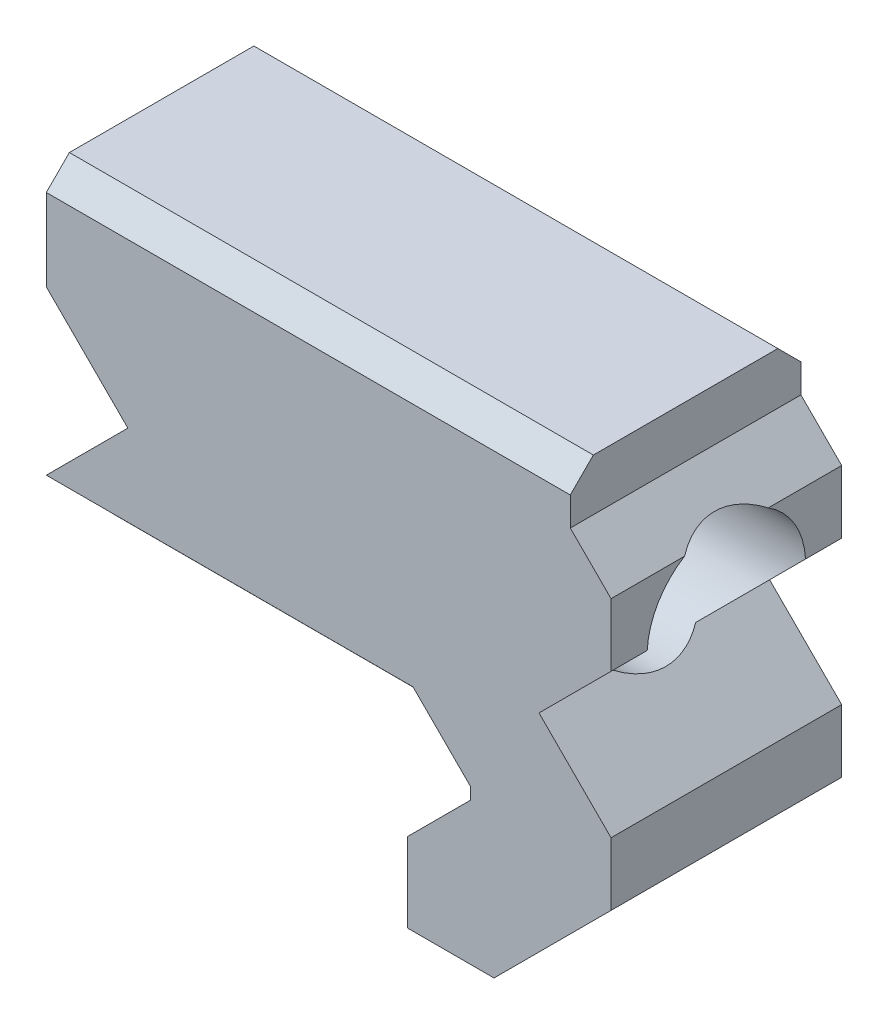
ISO-10303-21;
HEADER;
FILE_DESCRIPTION(('STEP AP214'),'2;1');
FILE_NAME('part.step','',(''),(''),'','','');
FILE_SCHEMA(('AUTOMOTIVE_DESIGN { 1 0 10303 214 1 1 1 1 }'));
ENDSEC;
DATA;
#1=APPLICATION_CONTEXT('core data for automotive mechanical design processes');
#2=APPLICATION_PROTOCOL_DEFINITION('international standard','automotive_design',2000,#1);
#3=PRODUCT_CONTEXT('',#1,'mechanical');
#4=PRODUCT('Part','Part','',(#3));
#5=PRODUCT_RELATED_PRODUCT_CATEGORY('part','',(#4));
#6=PRODUCT_DEFINITION_FORMATION('','',#4);
#7=PRODUCT_DEFINITION_CONTEXT('part definition',#1,'design');
#8=PRODUCT_DEFINITION('design','',#6,#7);
#9=PRODUCT_DEFINITION_SHAPE('','',#8);
#10=(LENGTH_UNIT() NAMED_UNIT(*) SI_UNIT(.MILLI.,.METRE.));
#11=(NAMED_UNIT(*) PLANE_ANGLE_UNIT() SI_UNIT($,.RADIAN.));
#12=(NAMED_UNIT(*) SI_UNIT($,.STERADIAN.) SOLID_ANGLE_UNIT());
#13=UNCERTAINTY_MEASURE_WITH_UNIT(LENGTH_MEASURE(1.E-05),#10,'distance_accuracy_value','');
#14=(GEOMETRIC_REPRESENTATION_CONTEXT(3) GLOBAL_UNCERTAINTY_ASSIGNED_CONTEXT((#13)) GLOBAL_UNIT_ASSIGNED_CONTEXT((#10,
#11,#12)) REPRESENTATION_CONTEXT('',''));
#15=CARTESIAN_POINT('',(0.,0.,0.));
#16=DIRECTION('',(0.,0.,1.));
#17=DIRECTION('',(1.,0.,0.));
#18=AXIS2_PLACEMENT_3D('',#15,#16,#17);
#19=CARTESIAN_POINT('',(-4.81965000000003,2.794,3.25754999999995));
#20=DIRECTION('',(0.,1.,0.));
#21=DIRECTION('',(-1.,0.,0.));
#22=AXIS2_PLACEMENT_3D('',#19,#20,#21);
#23=PLANE('',#22);
#24=DIRECTION('',(0.,0.,-1.));
#25=VECTOR('',#24,1.);
#26=CARTESIAN_POINT('',(11.33475,2.794,3.25755000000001));
#27=LINE('',#26,#25);
#28=CARTESIAN_POINT('',(11.33475,2.794,0.717550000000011));
#29=VERTEX_POINT('',#28);
#30=CARTESIAN_POINT('',(11.33475,2.794,-1.74624999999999));
#31=VERTEX_POINT('',#30);
#32=EDGE_CURVE('E392',#29,#31,#27,.T.);
#33=ORIENTED_EDGE('',*,*,#32,.F.);
#34=DIRECTION('',(-1.,0.,0.));
#35=VECTOR('',#34,1.);
#36=CARTESIAN_POINT('',(-4.81965000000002,2.794,0.717549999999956));
#37=LINE('',#36,#35);
#38=CARTESIAN_POINT('',(-4.81965000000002,2.794,0.717549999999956));
#39=VERTEX_POINT('',#38);
#40=EDGE_CURVE('E261',#29,#39,#37,.T.);
#41=ORIENTED_EDGE('',*,*,#40,.T.);
#42=DIRECTION('',(0.,0.,-1.));
#43=VECTOR('',#42,1.);
#44=CARTESIAN_POINT('',(-4.81965000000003,2.794,3.25754999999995));
#45=LINE('',#44,#43);
#46=CARTESIAN_POINT('',(-4.81965000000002,2.794,-1.74625000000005));
#47=VERTEX_POINT('',#46);
#48=EDGE_CURVE('E396',#39,#47,#45,.T.);
#49=ORIENTED_EDGE('',*,*,#48,.T.);
#50=DIRECTION('',(-1.,0.,0.));
#51=VECTOR('',#50,1.);
#52=CARTESIAN_POINT('',(-4.81965000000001,2.794,-1.74625000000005));
#53=LINE('',#52,#51);
#54=EDGE_CURVE('E277',#31,#47,#53,.T.);
#55=ORIENTED_EDGE('',*,*,#54,.F.);
#56=EDGE_LOOP('',(#33,#41,#49,#55));
#57=FACE_BOUND('',#56,.T.);
#58=ADVANCED_FACE('F53',(#57),#23,.F.);
#59=CARTESIAN_POINT('',(-4.81964999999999,2.794,-6.97865000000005));
#60=VERTEX_POINT('',#59);
#61=CARTESIAN_POINT('',(-4.81964999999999,2.794,-9.44245000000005));
#62=VERTEX_POINT('',#61);
#63=EDGE_CURVE('E395',#60,#62,#45,.T.);
#64=ORIENTED_EDGE('',*,*,#63,.T.);
#65=DIRECTION('',(1.,0.,0.));
#66=VECTOR('',#65,1.);
#67=CARTESIAN_POINT('',(-4.81964999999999,2.794,-9.44245000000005));
#68=LINE('',#67,#66);
#69=CARTESIAN_POINT('',(11.33475,2.794,-9.44244999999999));
#70=VERTEX_POINT('',#69);
#71=EDGE_CURVE('E444',#62,#70,#68,.T.);
#72=ORIENTED_EDGE('',*,*,#71,.T.);
#73=CARTESIAN_POINT('',(11.33475,2.794,-6.97864999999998));
#74=VERTEX_POINT('',#73);
#75=EDGE_CURVE('E391',#74,#70,#27,.T.);
#76=ORIENTED_EDGE('',*,*,#75,.F.);
#77=DIRECTION('',(1.,0.,0.));
#78=VECTOR('',#77,1.);
#79=CARTESIAN_POINT('',(-4.81964999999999,2.794,-6.97865000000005));
#80=LINE('',#79,#78);
#81=EDGE_CURVE('E294',#60,#74,#80,.T.);
#82=ORIENTED_EDGE('',*,*,#81,.F.);
#83=EDGE_LOOP('',(#64,#72,#76,#82));
#84=FACE_BOUND('',#83,.T.);
#85=ADVANCED_FACE('F443',(#84),#23,.F.);
#86=CARTESIAN_POINT('',(20.05965,-1.3716,3.25755000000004));
#87=DIRECTION('',(-1.,0.,0.));
#88=DIRECTION('',(0.,-1.,0.));
#89=AXIS2_PLACEMENT_3D('',#86,#87,#88);
#90=PLANE('',#89);
#91=DIRECTION('',(0.,0.,-1.));
#92=VECTOR('',#91,1.);
#93=CARTESIAN_POINT('',(20.0596499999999,7.75067438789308,10.3570658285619));
#94=LINE('',#93,#92);
#95=CARTESIAN_POINT('',(20.05965,7.75067438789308,-7.84954801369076));
#96=VERTEX_POINT('',#95);
#97=CARTESIAN_POINT('',(20.05965,7.75067438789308,-9.44244999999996));
#98=VERTEX_POINT('',#97);
#99=EDGE_CURVE('E344',#96,#98,#94,.T.);
#100=ORIENTED_EDGE('',*,*,#99,.T.);
#101=DIRECTION('',(0.,1.,0.));
#102=VECTOR('',#101,1.);
#103=CARTESIAN_POINT('',(20.05965,-1.3716,-9.44244999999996));
#104=LINE('',#103,#102);
#105=CARTESIAN_POINT('',(20.05965,10.5229487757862,-9.44244999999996));
#106=VERTEX_POINT('',#105);
#107=EDGE_CURVE('E501',#98,#106,#104,.T.);
#108=ORIENTED_EDGE('',*,*,#107,.T.);
#109=DIRECTION('',(0.,0.,-1.));
#110=VECTOR('',#109,1.);
#111=CARTESIAN_POINT('',(20.05965,10.5229487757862,3.25755000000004));
#112=LINE('',#111,#110);
#113=CARTESIAN_POINT('',(20.05965,10.5229487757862,-6.20574539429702));
#114=VERTEX_POINT('',#113);
#115=EDGE_CURVE('E363',#114,#106,#112,.T.);
#116=ORIENTED_EDGE('',*,*,#115,.F.);
#117=CARTESIAN_POINT('',(20.05965,7.5565,-4.36244999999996));
#118=DIRECTION('',(-1.,0.,0.));
#119=DIRECTION('',(0.,-1.,0.));
#120=AXIS2_PLACEMENT_3D('',#117,#118,#119);
#121=CIRCLE('',#120,3.4925);
#122=EDGE_CURVE('E318',#114,#96,#121,.T.);
#123=ORIENTED_EDGE('',*,*,#122,.T.);
#124=EDGE_LOOP('',(#100,#108,#116,#123));
#125=FACE_BOUND('',#124,.T.);
#126=ADVANCED_FACE('F647',(#125),#90,.F.);
#127=CARTESIAN_POINT('',(20.05965,10.5229487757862,0.717550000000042));
#128=VERTEX_POINT('',#127);
#129=CARTESIAN_POINT('',(20.05965,10.5229487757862,-2.51915460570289));
#130=VERTEX_POINT('',#129);
#131=EDGE_CURVE('E364',#128,#130,#112,.T.);
#132=ORIENTED_EDGE('',*,*,#131,.F.);
#133=DIRECTION('',(0.,-1.,0.));
#134=VECTOR('',#133,1.);
#135=CARTESIAN_POINT('',(20.05965,-1.3716,0.717550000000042));
#136=LINE('',#135,#134);
#137=CARTESIAN_POINT('',(20.05965,7.75067438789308,0.717550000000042));
#138=VERTEX_POINT('',#137);
#139=EDGE_CURVE('E557',#128,#138,#136,.T.);
#140=ORIENTED_EDGE('',*,*,#139,.T.);
#141=CARTESIAN_POINT('',(20.05965,7.75067438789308,-0.875351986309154));
#142=VERTEX_POINT('',#141);
#143=EDGE_CURVE('E345',#138,#142,#94,.T.);
#144=ORIENTED_EDGE('',*,*,#143,.T.);
#145=CARTESIAN_POINT('',(20.05965,7.5565,-4.36244999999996));
#146=DIRECTION('',(-1.,0.,0.));
#147=DIRECTION('',(0.,-1.,0.));
#148=AXIS2_PLACEMENT_3D('',#145,#146,#147);
#149=CIRCLE('',#148,3.4925);
#150=EDGE_CURVE('E314',#142,#130,#149,.T.);
#151=ORIENTED_EDGE('',*,*,#150,.T.);
#152=EDGE_LOOP('',(#132,#140,#144,#151));
#153=FACE_BOUND('',#152,.T.);
#154=ADVANCED_FACE('F612',(#153),#90,.F.);
#155=DIRECTION('',(0.,0.,-1.));
#156=VECTOR('',#155,1.);
#157=CARTESIAN_POINT('',(20.0596499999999,1.40067438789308,10.3570658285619));
#158=LINE('',#157,#156);
#159=CARTESIAN_POINT('',(20.05965,1.40067438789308,0.717550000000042));
#160=VERTEX_POINT('',#159);
#161=CARTESIAN_POINT('',(20.05965,1.40067438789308,-9.44244999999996));
#162=VERTEX_POINT('',#161);
#163=EDGE_CURVE('E348',#160,#162,#158,.T.);
#164=ORIENTED_EDGE('',*,*,#163,.F.);
#165=DIRECTION('',(0.,-1.,0.));
#166=VECTOR('',#165,1.);
#167=CARTESIAN_POINT('',(20.05965,-1.3716,0.717550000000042));
#168=LINE('',#167,#166);
#169=CARTESIAN_POINT('',(20.05965,-1.3716,0.717550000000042));
#170=VERTEX_POINT('',#169);
#171=EDGE_CURVE('E553',#160,#170,#168,.T.);
#172=ORIENTED_EDGE('',*,*,#171,.T.);
#173=DIRECTION('',(0.,0.,-1.));
#174=VECTOR('',#173,1.);
#175=CARTESIAN_POINT('',(20.05965,-1.3716,3.25755000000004));
#176=LINE('',#175,#174);
#177=CARTESIAN_POINT('',(20.05965,-1.3716,-9.44244999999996));
#178=VERTEX_POINT('',#177);
#179=EDGE_CURVE('E367',#170,#178,#176,.T.);
#180=ORIENTED_EDGE('',*,*,#179,.T.);
#181=DIRECTION('',(0.,1.,0.));
#182=VECTOR('',#181,1.);
#183=CARTESIAN_POINT('',(20.05965,-1.3716,-9.44244999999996));
#184=LINE('',#183,#182);
#185=EDGE_CURVE('E494',#178,#162,#184,.T.);
#186=ORIENTED_EDGE('',*,*,#185,.T.);
#187=EDGE_LOOP('',(#164,#172,#180,#186));
#188=FACE_BOUND('',#187,.T.);
#189=ADVANCED_FACE('F600',(#188),#90,.F.);
#190=CARTESIAN_POINT('',(-1.22754755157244,6.38610244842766,25.7722212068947));
#191=DIRECTION('',(-0.707106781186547,-0.707106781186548,0.));
#192=DIRECTION('',(0.707106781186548,-0.707106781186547,0.));
#193=AXIS2_PLACEMENT_3D('',#190,#191,#192);
#194=PLANE('',#193);
#195=DIRECTION('',(-0.707106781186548,0.707106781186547,0.));
#196=VECTOR('',#195,1.);
#197=CARTESIAN_POINT('',(-1.22754755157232,6.38610244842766,-9.44245000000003));
#198=LINE('',#197,#196);
#199=CARTESIAN_POINT('',(-1.22754755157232,6.38610244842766,-9.44245000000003));
#200=VERTEX_POINT('',#199);
#201=CARTESIAN_POINT('',(-4.81964999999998,9.97820489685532,-9.44245000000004));
#202=VERTEX_POINT('',#201);
#203=EDGE_CURVE('E540',#200,#202,#198,.T.);
#204=ORIENTED_EDGE('',*,*,#203,.F.);
#205=DIRECTION('',(0.,0.,-1.));
#206=VECTOR('',#205,1.);
#207=CARTESIAN_POINT('',(-1.22754755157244,6.38610244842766,25.7722212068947));
#208=LINE('',#207,#206);
#209=CARTESIAN_POINT('',(-1.22754755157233,6.38610244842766,-7.65300099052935));
#210=VERTEX_POINT('',#209);
#211=EDGE_CURVE('E356',#210,#200,#208,.T.);
#212=ORIENTED_EDGE('',*,*,#211,.F.);
#213=CARTESIAN_POINT('',(-2.39794510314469,7.5565,-4.36245000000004));
#214=DIRECTION('',(-0.707106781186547,-0.707106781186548,0.));
#215=DIRECTION('',(0.707106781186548,-0.707106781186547,0.));
#216=AXIS2_PLACEMENT_3D('',#213,#214,#215);
#217=ELLIPSE('',#216,4.93914086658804,3.4925);
#218=CARTESIAN_POINT('',(-4.81964999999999,9.97820489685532,-6.87897570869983));
#219=VERTEX_POINT('',#218);
#220=EDGE_CURVE('E337',#219,#210,#217,.T.);
#221=ORIENTED_EDGE('',*,*,#220,.F.);
#222=DIRECTION('',(0.,0.,-1.));
#223=VECTOR('',#222,1.);
#224=CARTESIAN_POINT('',(-4.81965000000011,9.97820489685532,25.7722212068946));
#225=LINE('',#224,#223);
#226=EDGE_CURVE('E352',#219,#202,#225,.T.);
#227=ORIENTED_EDGE('',*,*,#226,.T.);
#228=EDGE_LOOP('',(#204,#212,#221,#227));
#229=FACE_BOUND('',#228,.T.);
#230=ADVANCED_FACE('F729',(#229),#194,.T.);
#231=CARTESIAN_POINT('',(11.33475,2.794,3.25755000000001));
#232=DIRECTION('',(0.707106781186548,0.707106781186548,0.));
#233=DIRECTION('',(-0.707106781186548,0.707106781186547,0.));
#234=AXIS2_PLACEMENT_3D('',#231,#232,#233);
#235=PLANE('',#234);
#236=DIRECTION('',(0.,0.,-1.));
#237=VECTOR('',#236,1.);
#238=CARTESIAN_POINT('',(13.86205,0.266700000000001,3.25755000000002));
#239=LINE('',#238,#237);
#240=CARTESIAN_POINT('',(13.86205,0.266700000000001,0.71755000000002));
#241=VERTEX_POINT('',#240);
#242=CARTESIAN_POINT('',(13.86205,0.266700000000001,-9.44244999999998));
#243=VERTEX_POINT('',#242);
#244=EDGE_CURVE('E387',#241,#243,#239,.T.);
#245=ORIENTED_EDGE('',*,*,#244,.F.);
#246=DIRECTION('',(-0.707106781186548,0.707106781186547,0.));
#247=VECTOR('',#246,1.);
#248=CARTESIAN_POINT('',(11.33475,2.794,0.717550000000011));
#249=LINE('',#248,#247);
#250=EDGE_CURVE('E268',#241,#29,#249,.T.);
#251=ORIENTED_EDGE('',*,*,#250,.T.);
#252=ORIENTED_EDGE('',*,*,#32,.T.);
#253=DIRECTION('',(0.,0.,1.));
#254=VECTOR('',#253,1.);
#255=CARTESIAN_POINT('',(11.33475,2.794,-6.97864999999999));
#256=LINE('',#255,#254);
#257=EDGE_CURVE('E283',#74,#31,#256,.T.);
#258=ORIENTED_EDGE('',*,*,#257,.F.);
#259=ORIENTED_EDGE('',*,*,#75,.T.);
#260=DIRECTION('',(0.707106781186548,-0.707106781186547,0.));
#261=VECTOR('',#260,1.);
#262=CARTESIAN_POINT('',(11.33475,2.794,-9.44244999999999));
#263=LINE('',#262,#261);
#264=EDGE_CURVE('E529',#70,#243,#263,.T.);
#265=ORIENTED_EDGE('',*,*,#264,.T.);
#266=EDGE_LOOP('',(#245,#251,#252,#258,#259,#265));
#267=FACE_BOUND('',#266,.T.);
#268=ADVANCED_FACE('F449',(#267),#235,.F.);
#269=CARTESIAN_POINT('',(13.86205,0.266700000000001,3.25755000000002));
#270=DIRECTION('',(1.,0.,0.));
#271=DIRECTION('',(0.,0.,-1.));
#272=AXIS2_PLACEMENT_3D('',#269,#270,#271);
#273=PLANE('',#272);
#274=DIRECTION('',(0.,0.,-1.));
#275=VECTOR('',#274,1.);
#276=CARTESIAN_POINT('',(13.86205,-0.266699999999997,3.25755000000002));
#277=LINE('',#276,#275);
#278=CARTESIAN_POINT('',(13.86205,-0.266699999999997,0.71755000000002));
#279=VERTEX_POINT('',#278);
#280=CARTESIAN_POINT('',(13.86205,-0.266699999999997,-9.44244999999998));
#281=VERTEX_POINT('',#280);
#282=EDGE_CURVE('E383',#279,#281,#277,.T.);
#283=ORIENTED_EDGE('',*,*,#282,.F.);
#284=DIRECTION('',(0.,1.,0.));
#285=VECTOR('',#284,1.);
#286=CARTESIAN_POINT('',(13.86205,0.266700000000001,0.71755000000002));
#287=LINE('',#286,#285);
#288=EDGE_CURVE('E579',#279,#241,#287,.T.);
#289=ORIENTED_EDGE('',*,*,#288,.T.);
#290=ORIENTED_EDGE('',*,*,#244,.T.);
#291=DIRECTION('',(0.,-1.,0.));
#292=VECTOR('',#291,1.);
#293=CARTESIAN_POINT('',(13.86205,0.266700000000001,-9.44244999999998));
#294=LINE('',#293,#292);
#295=EDGE_CURVE('E525',#243,#281,#294,.T.);
#296=ORIENTED_EDGE('',*,*,#295,.T.);
#297=EDGE_LOOP('',(#283,#289,#290,#296));
#298=FACE_BOUND('',#297,.T.);
#299=ADVANCED_FACE('F585',(#298),#273,.F.);
#300=CARTESIAN_POINT('',(11.09345,-3.03530000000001,3.25755000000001));
#301=DIRECTION('',(0.707106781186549,-0.707106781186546,0.));
#302=DIRECTION('',(0.707106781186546,0.707106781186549,0.));
#303=AXIS2_PLACEMENT_3D('',#300,#301,#302);
#304=PLANE('',#303);
#305=DIRECTION('',(0.,0.,-1.));
#306=VECTOR('',#305,1.);
#307=CARTESIAN_POINT('',(11.09345,-3.03530000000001,3.25755000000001));
#308=LINE('',#307,#306);
#309=CARTESIAN_POINT('',(11.09345,-3.03530000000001,0.717550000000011));
#310=VERTEX_POINT('',#309);
#311=CARTESIAN_POINT('',(11.09345,-3.03530000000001,-9.44244999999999));
#312=VERTEX_POINT('',#311);
#313=EDGE_CURVE('E379',#310,#312,#308,.T.);
#314=ORIENTED_EDGE('',*,*,#313,.F.);
#315=DIRECTION('',(0.707106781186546,0.707106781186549,0.));
#316=VECTOR('',#315,1.);
#317=CARTESIAN_POINT('',(11.09345,-3.03530000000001,0.717550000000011));
#318=LINE('',#317,#316);
#319=EDGE_CURVE('E575',#310,#279,#318,.T.);
#320=ORIENTED_EDGE('',*,*,#319,.T.);
#321=ORIENTED_EDGE('',*,*,#282,.T.);
#322=DIRECTION('',(-0.707106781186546,-0.707106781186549,0.));
#323=VECTOR('',#322,1.);
#324=CARTESIAN_POINT('',(11.09345,-3.03530000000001,-9.44244999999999));
#325=LINE('',#324,#323);
#326=EDGE_CURVE('E521',#281,#312,#325,.T.);
#327=ORIENTED_EDGE('',*,*,#326,.T.);
#328=EDGE_LOOP('',(#314,#320,#321,#327));
#329=FACE_BOUND('',#328,.T.);
#330=ADVANCED_FACE('F589',(#329),#304,.F.);
#331=CARTESIAN_POINT('',(11.09345,-6.5278,3.25755000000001));
#332=DIRECTION('',(1.,0.,0.));
#333=DIRECTION('',(0.,0.,-1.));
#334=AXIS2_PLACEMENT_3D('',#331,#332,#333);
#335=PLANE('',#334);
#336=DIRECTION('',(0.,0.,-1.));
#337=VECTOR('',#336,1.);
#338=CARTESIAN_POINT('',(11.09345,-6.5278,3.25755000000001));
#339=LINE('',#338,#337);
#340=CARTESIAN_POINT('',(11.09345,-6.5278,0.717550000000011));
#341=VERTEX_POINT('',#340);
#342=CARTESIAN_POINT('',(11.09345,-6.5278,-9.44244999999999));
#343=VERTEX_POINT('',#342);
#344=EDGE_CURVE('E375',#341,#343,#339,.T.);
#345=ORIENTED_EDGE('',*,*,#344,.F.);
#346=DIRECTION('',(0.,1.,0.));
#347=VECTOR('',#346,1.);
#348=CARTESIAN_POINT('',(11.09345,-6.5278,0.717550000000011));
#349=LINE('',#348,#347);
#350=EDGE_CURVE('E571',#341,#310,#349,.T.);
#351=ORIENTED_EDGE('',*,*,#350,.T.);
#352=ORIENTED_EDGE('',*,*,#313,.T.);
#353=DIRECTION('',(0.,-1.,0.));
#354=VECTOR('',#353,1.);
#355=CARTESIAN_POINT('',(11.09345,-6.5278,-9.44244999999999));
#356=LINE('',#355,#354);
#357=EDGE_CURVE('E517',#312,#343,#356,.T.);
#358=ORIENTED_EDGE('',*,*,#357,.T.);
#359=EDGE_LOOP('',(#345,#351,#352,#358));
#360=FACE_BOUND('',#359,.T.);
#361=ADVANCED_FACE('F592',(#360),#335,.F.);
#362=CARTESIAN_POINT('',(11.09345,-6.5278,3.25755000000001));
#363=DIRECTION('',(0.,1.,0.));
#364=DIRECTION('',(-1.,0.,0.));
#365=AXIS2_PLACEMENT_3D('',#362,#363,#364);
#366=PLANE('',#365);
#367=DIRECTION('',(0.,0.,-1.));
#368=VECTOR('',#367,1.);
#369=CARTESIAN_POINT('',(14.90345,-6.5278,3.25755000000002));
#370=LINE('',#369,#368);
#371=CARTESIAN_POINT('',(14.90345,-6.5278,0.717550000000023));
#372=VERTEX_POINT('',#371);
#373=CARTESIAN_POINT('',(14.90345,-6.5278,-9.44244999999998));
#374=VERTEX_POINT('',#373);
#375=EDGE_CURVE('E371',#372,#374,#370,.T.);
#376=ORIENTED_EDGE('',*,*,#375,.F.);
#377=DIRECTION('',(-1.,0.,0.));
#378=VECTOR('',#377,1.);
#379=CARTESIAN_POINT('',(11.09345,-6.5278,0.717550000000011));
#380=LINE('',#379,#378);
#381=EDGE_CURVE('E567',#372,#341,#380,.T.);
#382=ORIENTED_EDGE('',*,*,#381,.T.);
#383=ORIENTED_EDGE('',*,*,#344,.T.);
#384=DIRECTION('',(1.,0.,0.));
#385=VECTOR('',#384,1.);
#386=CARTESIAN_POINT('',(11.09345,-6.5278,-9.44244999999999));
#387=LINE('',#386,#385);
#388=EDGE_CURVE('E513',#343,#374,#387,.T.);
#389=ORIENTED_EDGE('',*,*,#388,.T.);
#390=EDGE_LOOP('',(#376,#382,#383,#389));
#391=FACE_BOUND('',#390,.T.);
#392=ADVANCED_FACE('F595',(#391),#366,.F.);
#393=CARTESIAN_POINT('',(14.90345,-6.5278,3.25755000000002));
#394=DIRECTION('',(-0.707106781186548,0.707106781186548,0.));
#395=DIRECTION('',(-0.707106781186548,-0.707106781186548,0.));
#396=AXIS2_PLACEMENT_3D('',#393,#394,#395);
#397=PLANE('',#396);
#398=ORIENTED_EDGE('',*,*,#179,.F.);
#399=DIRECTION('',(-0.707106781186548,-0.707106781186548,0.));
#400=VECTOR('',#399,1.);
#401=CARTESIAN_POINT('',(14.90345,-6.5278,0.717550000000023));
#402=LINE('',#401,#400);
#403=EDGE_CURVE('E563',#170,#372,#402,.T.);
#404=ORIENTED_EDGE('',*,*,#403,.T.);
#405=ORIENTED_EDGE('',*,*,#375,.T.);
#406=DIRECTION('',(0.707106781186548,0.707106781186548,0.));
#407=VECTOR('',#406,1.);
#408=CARTESIAN_POINT('',(14.90345,-6.5278,-9.44244999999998));
#409=LINE('',#408,#407);
#410=EDGE_CURVE('E509',#374,#178,#409,.T.);
#411=ORIENTED_EDGE('',*,*,#410,.T.);
#412=EDGE_LOOP('',(#398,#404,#405,#411));
#413=FACE_BOUND('',#412,.T.);
#414=ADVANCED_FACE('F598',(#413),#397,.F.);
#415=CARTESIAN_POINT('',(18.2635987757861,12.319,3.25755000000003));
#416=DIRECTION('',(-0.707106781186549,-0.707106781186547,0.));
#417=DIRECTION('',(0.707106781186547,-0.707106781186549,0.));
#418=AXIS2_PLACEMENT_3D('',#415,#416,#417);
#419=PLANE('',#418);
#420=DIRECTION('',(0.,0.,-1.));
#421=VECTOR('',#420,1.);
#422=CARTESIAN_POINT('',(18.2635987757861,12.319,3.25755000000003));
#423=LINE('',#422,#421);
#424=CARTESIAN_POINT('',(18.2635987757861,12.319,0.717550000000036));
#425=VERTEX_POINT('',#424);
#426=CARTESIAN_POINT('',(18.2635987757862,12.319,-9.44244999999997));
#427=VERTEX_POINT('',#426);
#428=EDGE_CURVE('E360',#425,#427,#423,.T.);
#429=ORIENTED_EDGE('',*,*,#428,.F.);
#430=DIRECTION('',(0.707106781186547,-0.707106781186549,0.));
#431=VECTOR('',#430,1.);
#432=CARTESIAN_POINT('',(18.2635987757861,12.319,0.717550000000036));
#433=LINE('',#432,#431);
#434=EDGE_CURVE('E257',#425,#128,#433,.T.);
#435=ORIENTED_EDGE('',*,*,#434,.T.);
#436=ORIENTED_EDGE('',*,*,#131,.T.);
#437=CARTESIAN_POINT('',(23.0260987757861,7.5565,-4.36244999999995));
#438=DIRECTION('',(-0.707106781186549,-0.707106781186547,0.));
#439=DIRECTION('',(0.707106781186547,-0.707106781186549,0.));
#440=AXIS2_PLACEMENT_3D('',#437,#438,#439);
#441=ELLIPSE('',#440,4.93914086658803,3.4925);
#442=EDGE_CURVE('E322',#130,#114,#441,.T.);
#443=ORIENTED_EDGE('',*,*,#442,.T.);
#444=ORIENTED_EDGE('',*,*,#115,.T.);
#445=DIRECTION('',(-0.707106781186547,0.707106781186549,0.));
#446=VECTOR('',#445,1.);
#447=CARTESIAN_POINT('',(18.2635987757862,12.319,-9.44244999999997));
#448=LINE('',#447,#446);
#449=EDGE_CURVE('E505',#106,#427,#448,.T.);
#450=ORIENTED_EDGE('',*,*,#449,.T.);
#451=EDGE_LOOP('',(#429,#435,#436,#443,#444,#450));
#452=FACE_BOUND('',#451,.T.);
#453=ADVANCED_FACE('F614',(#452),#419,.F.);
#454=CARTESIAN_POINT('',(-4.81965000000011,2.794,25.7722212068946));
#455=DIRECTION('',(-0.707106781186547,0.707106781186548,0.));
#456=DIRECTION('',(-0.707106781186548,-0.707106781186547,0.));
#457=AXIS2_PLACEMENT_3D('',#454,#455,#456);
#458=PLANE('',#457);
#459=DIRECTION('',(-0.707106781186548,-0.707106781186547,0.));
#460=VECTOR('',#459,1.);
#461=CARTESIAN_POINT('',(-4.81965000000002,2.794,0.717549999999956));
#462=LINE('',#461,#460);
#463=CARTESIAN_POINT('',(-1.22754755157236,6.38610244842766,0.717549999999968));
#464=VERTEX_POINT('',#463);
#465=EDGE_CURVE('E260',#464,#39,#462,.T.);
#466=ORIENTED_EDGE('',*,*,#465,.F.);
#467=CARTESIAN_POINT('',(-1.22754755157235,6.38610244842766,-1.07189900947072));
#468=VERTEX_POINT('',#467);
#469=EDGE_CURVE('E357',#464,#468,#208,.T.);
#470=ORIENTED_EDGE('',*,*,#469,.T.);
#471=CARTESIAN_POINT('',(-0.0571499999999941,7.5565,-4.36245000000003));
#472=DIRECTION('',(-0.707106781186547,0.707106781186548,0.));
#473=DIRECTION('',(0.707106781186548,0.707106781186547,0.));
#474=AXIS2_PLACEMENT_3D('',#471,#472,#473);
#475=ELLIPSE('',#474,4.93914086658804,3.4925);
#476=EDGE_CURVE('E333',#210,#468,#475,.T.);
#477=ORIENTED_EDGE('',*,*,#476,.F.);
#478=ORIENTED_EDGE('',*,*,#211,.T.);
#479=DIRECTION('',(0.707106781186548,0.707106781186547,0.));
#480=VECTOR('',#479,1.);
#481=CARTESIAN_POINT('',(-4.81964999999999,2.794,-9.44245000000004));
#482=LINE('',#481,#480);
#483=EDGE_CURVE('E461',#62,#200,#482,.T.);
#484=ORIENTED_EDGE('',*,*,#483,.F.);
#485=ORIENTED_EDGE('',*,*,#63,.F.);
#486=DIRECTION('',(0.,0.,-1.));
#487=VECTOR('',#486,1.);
#488=CARTESIAN_POINT('',(-4.81964999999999,2.794,-6.97865000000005));
#489=LINE('',#488,#487);
#490=EDGE_CURVE('E290',#47,#60,#489,.T.);
#491=ORIENTED_EDGE('',*,*,#490,.F.);
#492=ORIENTED_EDGE('',*,*,#48,.F.);
#493=EDGE_LOOP('',(#466,#470,#477,#478,#484,#485,#491,#492));
#494=FACE_BOUND('',#493,.T.);
#495=ADVANCED_FACE('F458',(#494),#458,.T.);
#496=CARTESIAN_POINT('',(-4.81965000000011,9.97820489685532,25.7722212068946));
#497=DIRECTION('',(-1.,0.,0.));
#498=DIRECTION('',(0.,0.,1.));
#499=AXIS2_PLACEMENT_3D('',#496,#497,#498);
#500=PLANE('',#499);
#501=DIRECTION('',(0.,-0.707106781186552,0.707106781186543));
#502=VECTOR('',#501,1.);
#503=CARTESIAN_POINT('',(-4.81965000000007,-0.748245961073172,15.045770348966));
#504=LINE('',#503,#502);
#505=CARTESIAN_POINT('',(-4.81964999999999,14.5959743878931,-0.298450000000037));
#506=VERTEX_POINT('',#505);
#507=CARTESIAN_POINT('',(-4.81965000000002,13.5799743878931,0.717549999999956));
#508=VERTEX_POINT('',#507);
#509=EDGE_CURVE('E76',#506,#508,#504,.T.);
#510=ORIENTED_EDGE('',*,*,#509,.F.);
#511=DIRECTION('',(0.,0.,1.));
#512=VECTOR('',#511,1.);
#513=CARTESIAN_POINT('',(-4.81965000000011,14.5959743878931,25.7722212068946));
#514=LINE('',#513,#512);
#515=CARTESIAN_POINT('',(-4.81964999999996,14.5959743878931,-8.42645000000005));
#516=VERTEX_POINT('',#515);
#517=EDGE_CURVE('E303',#516,#506,#514,.T.);
#518=ORIENTED_EDGE('',*,*,#517,.F.);
#519=DIRECTION('',(0.,0.707106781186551,0.707106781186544));
#520=VECTOR('',#519,1.);
#521=CARTESIAN_POINT('',(-4.81965000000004,29.3864252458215,6.36400085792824));
#522=LINE('',#521,#520);
#523=CARTESIAN_POINT('',(-4.81964999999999,13.5799743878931,-9.44245000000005));
#524=VERTEX_POINT('',#523);
#525=EDGE_CURVE('E490',#524,#516,#522,.T.);
#526=ORIENTED_EDGE('',*,*,#525,.F.);
#527=DIRECTION('',(0.,1.,0.));
#528=VECTOR('',#527,1.);
#529=CARTESIAN_POINT('',(-4.81964999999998,9.97820489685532,-9.44245000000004));
#530=LINE('',#529,#528);
#531=EDGE_CURVE('E543',#202,#524,#530,.T.);
#532=ORIENTED_EDGE('',*,*,#531,.F.);
#533=ORIENTED_EDGE('',*,*,#226,.F.);
#534=CARTESIAN_POINT('',(-4.81965,7.5565,-4.36245000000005));
#535=DIRECTION('',(-1.,0.,0.));
#536=DIRECTION('',(0.,0.,1.));
#537=AXIS2_PLACEMENT_3D('',#534,#535,#536);
#538=CIRCLE('',#537,3.4925);
#539=CARTESIAN_POINT('',(-4.81965000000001,9.97820489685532,-1.84592429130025));
#540=VERTEX_POINT('',#539);
#541=EDGE_CURVE('E330',#540,#219,#538,.T.);
#542=ORIENTED_EDGE('',*,*,#541,.F.);
#543=CARTESIAN_POINT('',(-4.81965000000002,9.97820489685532,0.717549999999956));
#544=VERTEX_POINT('',#543);
#545=EDGE_CURVE('E353',#544,#540,#225,.T.);
#546=ORIENTED_EDGE('',*,*,#545,.F.);
#547=DIRECTION('',(0.,-1.,0.));
#548=VECTOR('',#547,1.);
#549=CARTESIAN_POINT('',(-4.81965000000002,9.97820489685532,0.717549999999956));
#550=LINE('',#549,#548);
#551=EDGE_CURVE('E274',#508,#544,#550,.T.);
#552=ORIENTED_EDGE('',*,*,#551,.F.);
#553=EDGE_LOOP('',(#510,#518,#526,#532,#533,#542,#546,#552));
#554=FACE_BOUND('',#553,.T.);
#555=ADVANCED_FACE('F621',(#554),#500,.T.);
#556=DIRECTION('',(0.707106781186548,-0.707106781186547,0.));
#557=VECTOR('',#556,1.);
#558=CARTESIAN_POINT('',(-1.22754755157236,6.38610244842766,0.717549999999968));
#559=LINE('',#558,#557);
#560=EDGE_CURVE('E265',#544,#464,#559,.T.);
#561=ORIENTED_EDGE('',*,*,#560,.F.);
#562=ORIENTED_EDGE('',*,*,#545,.T.);
#563=CARTESIAN_POINT('',(-2.39794510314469,7.5565,-4.36245000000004));
#564=DIRECTION('',(-0.707106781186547,-0.707106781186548,0.));
#565=DIRECTION('',(0.707106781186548,-0.707106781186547,0.));
#566=AXIS2_PLACEMENT_3D('',#563,#564,#565);
#567=ELLIPSE('',#566,4.93914086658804,3.4925);
#568=EDGE_CURVE('E326',#468,#540,#567,.T.);
#569=ORIENTED_EDGE('',*,*,#568,.F.);
#570=ORIENTED_EDGE('',*,*,#469,.F.);
#571=EDGE_LOOP('',(#561,#562,#569,#570));
#572=FACE_BOUND('',#571,.T.);
#573=ADVANCED_FACE('F718',(#572),#194,.T.);
#574=CARTESIAN_POINT('',(18.2635987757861,12.319,26.5581293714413));
#575=DIRECTION('',(-1.,0.,0.));
#576=DIRECTION('',(0.,0.,1.));
#577=AXIS2_PLACEMENT_3D('',#574,#575,#576);
#578=PLANE('',#577);
#579=DIRECTION('',(0.,0.,1.));
#580=VECTOR('',#579,1.);
#581=CARTESIAN_POINT('',(18.2635987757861,14.5959743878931,26.5581293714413));
#582=LINE('',#581,#580);
#583=CARTESIAN_POINT('',(18.2635987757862,14.5959743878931,-8.42644999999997));
#584=VERTEX_POINT('',#583);
#585=CARTESIAN_POINT('',(18.2635987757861,14.5959743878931,-0.298449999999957));
#586=VERTEX_POINT('',#585);
#587=EDGE_CURVE('E251',#584,#586,#582,.T.);
#588=ORIENTED_EDGE('',*,*,#587,.T.);
#589=DIRECTION('',(0.,-0.707106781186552,0.707106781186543));
#590=VECTOR('',#589,1.);
#591=CARTESIAN_POINT('',(18.2635987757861,0.029197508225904,14.268326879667));
#592=LINE('',#591,#590);
#593=CARTESIAN_POINT('',(18.2635987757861,13.5799743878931,0.717550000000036));
#594=VERTEX_POINT('',#593);
#595=EDGE_CURVE('E237',#586,#594,#592,.T.);
#596=ORIENTED_EDGE('',*,*,#595,.T.);
#597=DIRECTION('',(0.,-1.,0.));
#598=VECTOR('',#597,1.);
#599=CARTESIAN_POINT('',(18.2635987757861,12.319,0.717550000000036));
#600=LINE('',#599,#598);
#601=EDGE_CURVE('E248',#594,#425,#600,.T.);
#602=ORIENTED_EDGE('',*,*,#601,.T.);
#603=ORIENTED_EDGE('',*,*,#428,.T.);
#604=DIRECTION('',(0.,1.,0.));
#605=VECTOR('',#604,1.);
#606=CARTESIAN_POINT('',(18.2635987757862,12.319,-9.44244999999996));
#607=LINE('',#606,#605);
#608=CARTESIAN_POINT('',(18.2635987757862,13.5799743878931,-9.44244999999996));
#609=VERTEX_POINT('',#608);
#610=EDGE_CURVE('E534',#427,#609,#607,.T.);
#611=ORIENTED_EDGE('',*,*,#610,.T.);
#612=DIRECTION('',(0.,0.707106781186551,0.707106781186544));
#613=VECTOR('',#612,1.);
#614=CARTESIAN_POINT('',(18.2635987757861,30.9497768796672,7.92735249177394));
#615=LINE('',#614,#613);
#616=EDGE_CURVE('E69',#609,#584,#615,.T.);
#617=ORIENTED_EDGE('',*,*,#616,.T.);
#618=EDGE_LOOP('',(#588,#596,#602,#603,#611,#617));
#619=FACE_BOUND('',#618,.T.);
#620=ADVANCED_FACE('F246',(#619),#578,.F.);
#621=CARTESIAN_POINT('',(20.0596499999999,7.75067438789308,10.3570658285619));
#622=DIRECTION('',(0.707106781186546,-0.707106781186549,0.));
#623=DIRECTION('',(0.707106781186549,0.707106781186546,0.));
#624=AXIS2_PLACEMENT_3D('',#621,#622,#623);
#625=PLANE('',#624);
#626=DIRECTION('',(-0.707106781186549,-0.707106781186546,0.));
#627=VECTOR('',#626,1.);
#628=CARTESIAN_POINT('',(20.05965,7.75067438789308,-9.44244999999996));
#629=LINE('',#628,#627);
#630=CARTESIAN_POINT('',(16.88465,4.57567438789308,-9.44244999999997));
#631=VERTEX_POINT('',#630);
#632=EDGE_CURVE('E478',#98,#631,#629,.T.);
#633=ORIENTED_EDGE('',*,*,#632,.F.);
#634=ORIENTED_EDGE('',*,*,#99,.F.);
#635=CARTESIAN_POINT('',(19.8654756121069,7.5565,-4.36244999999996));
#636=DIRECTION('',(0.707106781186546,-0.707106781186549,0.));
#637=DIRECTION('',(0.707106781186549,0.707106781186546,0.));
#638=AXIS2_PLACEMENT_3D('',#635,#636,#637);
#639=ELLIPSE('',#638,4.93914086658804,3.4925);
#640=CARTESIAN_POINT('',(16.88465,4.57567438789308,-6.18240464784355));
#641=VERTEX_POINT('',#640);
#642=EDGE_CURVE('E311',#641,#96,#639,.T.);
#643=ORIENTED_EDGE('',*,*,#642,.F.);
#644=DIRECTION('',(0.,0.,-1.));
#645=VECTOR('',#644,1.);
#646=CARTESIAN_POINT('',(16.8846499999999,4.57567438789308,10.3570658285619));
#647=LINE('',#646,#645);
#648=EDGE_CURVE('E340',#641,#631,#647,.T.);
#649=ORIENTED_EDGE('',*,*,#648,.T.);
#650=EDGE_LOOP('',(#633,#634,#643,#649));
#651=FACE_BOUND('',#650,.T.);
#652=ADVANCED_FACE('F476',(#651),#625,.T.);
#653=DIRECTION('',(0.707106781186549,0.707106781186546,0.));
#654=VECTOR('',#653,1.);
#655=CARTESIAN_POINT('',(20.05965,7.75067438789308,0.717550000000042));
#656=LINE('',#655,#654);
#657=CARTESIAN_POINT('',(16.88465,4.57567438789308,0.71755000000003));
#658=VERTEX_POINT('',#657);
#659=EDGE_CURVE('E550',#658,#138,#656,.T.);
#660=ORIENTED_EDGE('',*,*,#659,.F.);
#661=CARTESIAN_POINT('',(16.88465,4.57567438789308,-2.54249535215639));
#662=VERTEX_POINT('',#661);
#663=EDGE_CURVE('E341',#658,#662,#647,.T.);
#664=ORIENTED_EDGE('',*,*,#663,.T.);
#665=CARTESIAN_POINT('',(19.8654756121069,7.5565,-4.36244999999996));
#666=DIRECTION('',(0.707106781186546,-0.707106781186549,0.));
#667=DIRECTION('',(0.707106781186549,0.707106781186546,0.));
#668=AXIS2_PLACEMENT_3D('',#665,#666,#667);
#669=ELLIPSE('',#668,4.93914086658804,3.4925);
#670=EDGE_CURVE('E307',#142,#662,#669,.T.);
#671=ORIENTED_EDGE('',*,*,#670,.F.);
#672=ORIENTED_EDGE('',*,*,#143,.F.);
#673=EDGE_LOOP('',(#660,#664,#671,#672));
#674=FACE_BOUND('',#673,.T.);
#675=ADVANCED_FACE('F604',(#674),#625,.T.);
#676=CARTESIAN_POINT('',(16.8846499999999,4.57567438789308,10.3570658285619));
#677=DIRECTION('',(0.707106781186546,0.707106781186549,0.));
#678=DIRECTION('',(-0.707106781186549,0.707106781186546,0.));
#679=AXIS2_PLACEMENT_3D('',#676,#677,#678);
#680=PLANE('',#679);
#681=DIRECTION('',(-0.707106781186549,0.707106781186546,0.));
#682=VECTOR('',#681,1.);
#683=CARTESIAN_POINT('',(16.88465,4.57567438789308,0.71755000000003));
#684=LINE('',#683,#682);
#685=EDGE_CURVE('E547',#160,#658,#684,.T.);
#686=ORIENTED_EDGE('',*,*,#685,.F.);
#687=ORIENTED_EDGE('',*,*,#163,.T.);
#688=DIRECTION('',(0.707106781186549,-0.707106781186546,0.));
#689=VECTOR('',#688,1.);
#690=CARTESIAN_POINT('',(16.88465,4.57567438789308,-9.44244999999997));
#691=LINE('',#690,#689);
#692=EDGE_CURVE('E485',#631,#162,#691,.T.);
#693=ORIENTED_EDGE('',*,*,#692,.F.);
#694=ORIENTED_EDGE('',*,*,#648,.F.);
#695=CARTESIAN_POINT('',(13.9038243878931,7.5565,-4.36244999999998));
#696=DIRECTION('',(0.707106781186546,0.707106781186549,0.));
#697=DIRECTION('',(0.707106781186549,-0.707106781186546,0.));
#698=AXIS2_PLACEMENT_3D('',#695,#696,#697);
#699=ELLIPSE('',#698,4.93914086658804,3.4925);
#700=EDGE_CURVE('E399',#662,#641,#699,.T.);
#701=ORIENTED_EDGE('',*,*,#700,.F.);
#702=ORIENTED_EDGE('',*,*,#663,.F.);
#703=EDGE_LOOP('',(#686,#687,#693,#694,#701,#702));
#704=FACE_BOUND('',#703,.T.);
#705=ADVANCED_FACE('F483',(#704),#680,.T.);
#706=CARTESIAN_POINT('',(-20.6649341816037,7.5565,-4.3624500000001));
#707=DIRECTION('',(1.,0.,0.));
#708=DIRECTION('',(0.,0.,-1.));
#709=AXIS2_PLACEMENT_3D('',#706,#707,#708);
#710=CYLINDRICAL_SURFACE('',#709,3.4925);
#711=ORIENTED_EDGE('',*,*,#220,.T.);
#712=ORIENTED_EDGE('',*,*,#476,.T.);
#713=ORIENTED_EDGE('',*,*,#568,.T.);
#714=ORIENTED_EDGE('',*,*,#541,.T.);
#715=EDGE_LOOP('',(#711,#712,#713,#714));
#716=FACE_BOUND('',#715,.T.);
#717=ORIENTED_EDGE('',*,*,#150,.F.);
#718=ORIENTED_EDGE('',*,*,#670,.T.);
#719=ORIENTED_EDGE('',*,*,#700,.T.);
#720=ORIENTED_EDGE('',*,*,#642,.T.);
#721=ORIENTED_EDGE('',*,*,#122,.F.);
#722=ORIENTED_EDGE('',*,*,#442,.F.);
#723=EDGE_LOOP('',(#717,#718,#719,#720,#721,#722));
#724=FACE_BOUND('',#723,.T.);
#725=ADVANCED_FACE('F608',(#716,#724),#710,.F.);
#726=CARTESIAN_POINT('',(57.8132165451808,14.5959743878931,-10.186398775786));
#727=DIRECTION('',(0.,-1.,0.));
#728=DIRECTION('',(1.,0.,0.));
#729=AXIS2_PLACEMENT_3D('',#726,#727,#728);
#730=PLANE('',#729);
#731=ORIENTED_EDGE('',*,*,#517,.T.);
#732=DIRECTION('',(1.,0.,0.));
#733=VECTOR('',#732,1.);
#734=CARTESIAN_POINT('',(-26.7672475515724,14.5959743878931,-0.298450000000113));
#735=LINE('',#734,#733);
#736=EDGE_CURVE('E253',#506,#586,#735,.T.);
#737=ORIENTED_EDGE('',*,*,#736,.T.);
#738=ORIENTED_EDGE('',*,*,#587,.F.);
#739=DIRECTION('',(1.,0.,0.));
#740=VECTOR('',#739,1.);
#741=CARTESIAN_POINT('',(-26.7672475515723,14.5959743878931,-8.42645000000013));
#742=LINE('',#741,#740);
#743=EDGE_CURVE('E625',#516,#584,#742,.T.);
#744=ORIENTED_EDGE('',*,*,#743,.F.);
#745=EDGE_LOOP('',(#731,#737,#738,#744));
#746=FACE_BOUND('',#745,.T.);
#747=ADVANCED_FACE('F624',(#746),#730,.F.);
#748=CARTESIAN_POINT('',(-4.81964999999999,-0.203199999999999,-6.97865000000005));
#749=DIRECTION('',(1.,0.,0.));
#750=DIRECTION('',(0.,0.,-1.));
#751=AXIS2_PLACEMENT_3D('',#748,#749,#750);
#752=PLANE('',#751);
#753=ORIENTED_EDGE('',*,*,#490,.T.);
#754=DIRECTION('',(0.,-0.984807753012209,0.173648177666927));
#755=VECTOR('',#754,1.);
#756=CARTESIAN_POINT('',(-4.81965,-0.203199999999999,-6.45016277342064));
#757=LINE('',#756,#755);
#758=CARTESIAN_POINT('',(-4.81965,-0.203199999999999,-6.45016277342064));
#759=VERTEX_POINT('',#758);
#760=EDGE_CURVE('E243',#60,#759,#757,.T.);
#761=ORIENTED_EDGE('',*,*,#760,.T.);
#762=DIRECTION('',(0.,0.,-1.));
#763=VECTOR('',#762,1.);
#764=CARTESIAN_POINT('',(-4.81964999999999,-0.203199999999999,-6.97865000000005));
#765=LINE('',#764,#763);
#766=CARTESIAN_POINT('',(-4.81965000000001,-0.203199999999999,-2.27473722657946));
#767=VERTEX_POINT('',#766);
#768=EDGE_CURVE('E278',#767,#759,#765,.T.);
#769=ORIENTED_EDGE('',*,*,#768,.F.);
#770=DIRECTION('',(0.,0.984807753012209,0.173648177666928));
#771=VECTOR('',#770,1.);
#772=CARTESIAN_POINT('',(-4.81965000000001,-0.203199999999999,-2.27473722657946));
#773=LINE('',#772,#771);
#774=EDGE_CURVE('E416',#767,#47,#773,.T.);
#775=ORIENTED_EDGE('',*,*,#774,.T.);
#776=EDGE_LOOP('',(#753,#761,#769,#775));
#777=FACE_BOUND('',#776,.T.);
#778=ADVANCED_FACE('F424',(#777),#752,.F.);
#779=CARTESIAN_POINT('',(11.33475,-0.203199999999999,-6.97864999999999));
#780=DIRECTION('',(-1.,0.,0.));
#781=DIRECTION('',(0.,0.,1.));
#782=AXIS2_PLACEMENT_3D('',#779,#780,#781);
#783=PLANE('',#782);
#784=DIRECTION('',(0.,0.,1.));
#785=VECTOR('',#784,1.);
#786=CARTESIAN_POINT('',(11.33475,-0.203199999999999,-6.97864999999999));
#787=LINE('',#786,#785);
#788=CARTESIAN_POINT('',(11.33475,-0.203199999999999,-6.45016277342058));
#789=VERTEX_POINT('',#788);
#790=CARTESIAN_POINT('',(11.33475,-0.203199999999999,-2.27473722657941));
#791=VERTEX_POINT('',#790);
#792=EDGE_CURVE('E282',#789,#791,#787,.T.);
#793=ORIENTED_EDGE('',*,*,#792,.F.);
#794=DIRECTION('',(0.,0.984807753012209,-0.173648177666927));
#795=VECTOR('',#794,1.);
#796=CARTESIAN_POINT('',(11.33475,-0.203199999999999,-6.45016277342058));
#797=LINE('',#796,#795);
#798=EDGE_CURVE('E413',#789,#74,#797,.T.);
#799=ORIENTED_EDGE('',*,*,#798,.T.);
#800=ORIENTED_EDGE('',*,*,#257,.T.);
#801=DIRECTION('',(0.,-0.984807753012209,-0.173648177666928));
#802=VECTOR('',#801,1.);
#803=CARTESIAN_POINT('',(11.33475,-0.203199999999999,-2.2747372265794));
#804=LINE('',#803,#802);
#805=EDGE_CURVE('E410',#31,#791,#804,.T.);
#806=ORIENTED_EDGE('',*,*,#805,.T.);
#807=EDGE_LOOP('',(#793,#799,#800,#806));
#808=FACE_BOUND('',#807,.T.);
#809=ADVANCED_FACE('F436',(#808),#783,.F.);
#810=CARTESIAN_POINT('',(3.25755000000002,-0.203199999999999,-11.98245));
#811=DIRECTION('',(0.,-1.,0.));
#812=DIRECTION('',(1.,0.,0.));
#813=AXIS2_PLACEMENT_3D('',#810,#811,#812);
#814=PLANE('',#813);
#815=ORIENTED_EDGE('',*,*,#768,.T.);
#816=DIRECTION('',(1.,0.,0.));
#817=VECTOR('',#816,1.);
#818=CARTESIAN_POINT('',(11.33475,-0.203199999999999,-6.45016277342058));
#819=LINE('',#818,#817);
#820=EDGE_CURVE('E406',#759,#789,#819,.T.);
#821=ORIENTED_EDGE('',*,*,#820,.T.);
#822=ORIENTED_EDGE('',*,*,#792,.T.);
#823=DIRECTION('',(-1.,0.,0.));
#824=VECTOR('',#823,1.);
#825=CARTESIAN_POINT('',(-4.81965000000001,-0.203199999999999,-2.27473722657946));
#826=LINE('',#825,#824);
#827=EDGE_CURVE('E402',#791,#767,#826,.T.);
#828=ORIENTED_EDGE('',*,*,#827,.T.);
#829=EDGE_LOOP('',(#815,#821,#822,#828));
#830=FACE_BOUND('',#829,.T.);
#831=ADVANCED_FACE('F429',(#830),#814,.T.);
#832=CARTESIAN_POINT('',(3.25755,-0.203199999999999,-6.45016277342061));
#833=DIRECTION('',(0.,-0.173648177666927,-0.984807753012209));
#834=DIRECTION('',(-1.,0.,0.));
#835=AXIS2_PLACEMENT_3D('',#832,#833,#834);
#836=PLANE('',#835);
#837=ORIENTED_EDGE('',*,*,#760,.F.);
#838=ORIENTED_EDGE('',*,*,#81,.T.);
#839=ORIENTED_EDGE('',*,*,#798,.F.);
#840=ORIENTED_EDGE('',*,*,#820,.F.);
#841=EDGE_LOOP('',(#837,#838,#839,#840));
#842=FACE_BOUND('',#841,.T.);
#843=ADVANCED_FACE('F432',(#842),#836,.T.);
#844=CARTESIAN_POINT('',(3.25754999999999,-0.203199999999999,-2.27473722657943));
#845=DIRECTION('',(0.,-0.173648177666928,0.984807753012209));
#846=DIRECTION('',(1.,0.,0.));
#847=AXIS2_PLACEMENT_3D('',#844,#845,#846);
#848=PLANE('',#847);
#849=ORIENTED_EDGE('',*,*,#805,.F.);
#850=ORIENTED_EDGE('',*,*,#54,.T.);
#851=ORIENTED_EDGE('',*,*,#774,.F.);
#852=ORIENTED_EDGE('',*,*,#827,.F.);
#853=EDGE_LOOP('',(#849,#850,#851,#852));
#854=FACE_BOUND('',#853,.T.);
#855=ADVANCED_FACE('F55',(#854),#848,.T.);
#856=CARTESIAN_POINT('',(59.0633475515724,14.5959743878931,-9.44244999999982));
#857=DIRECTION('',(0.,0.,1.));
#858=DIRECTION('',(1.,0.,0.));
#859=AXIS2_PLACEMENT_3D('',#856,#857,#858);
#860=PLANE('',#859);
#861=ORIENTED_EDGE('',*,*,#531,.T.);
#862=DIRECTION('',(1.,0.,0.));
#863=VECTOR('',#862,1.);
#864=CARTESIAN_POINT('',(59.0633475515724,13.5799743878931,-9.44244999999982));
#865=LINE('',#864,#863);
#866=EDGE_CURVE('E12',#524,#609,#865,.T.);
#867=ORIENTED_EDGE('',*,*,#866,.T.);
#868=ORIENTED_EDGE('',*,*,#610,.F.);
#869=ORIENTED_EDGE('',*,*,#449,.F.);
#870=ORIENTED_EDGE('',*,*,#107,.F.);
#871=ORIENTED_EDGE('',*,*,#632,.T.);
#872=ORIENTED_EDGE('',*,*,#692,.T.);
#873=ORIENTED_EDGE('',*,*,#185,.F.);
#874=ORIENTED_EDGE('',*,*,#410,.F.);
#875=ORIENTED_EDGE('',*,*,#388,.F.);
#876=ORIENTED_EDGE('',*,*,#357,.F.);
#877=ORIENTED_EDGE('',*,*,#326,.F.);
#878=ORIENTED_EDGE('',*,*,#295,.F.);
#879=ORIENTED_EDGE('',*,*,#264,.F.);
#880=ORIENTED_EDGE('',*,*,#71,.F.);
#881=ORIENTED_EDGE('',*,*,#483,.T.);
#882=ORIENTED_EDGE('',*,*,#203,.T.);
#883=EDGE_LOOP('',(#861,#867,#868,#869,#870,#871,#872,#873,#874,#875,#876,#877,#878,#879,#880,
#881,#882));
#884=FACE_BOUND('',#883,.T.);
#885=ADVANCED_FACE('F586',(#884),#860,.F.);
#886=CARTESIAN_POINT('',(59.0633475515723,14.5959743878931,0.717550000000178));
#887=DIRECTION('',(0.,0.,-1.));
#888=DIRECTION('',(-1.,0.,0.));
#889=AXIS2_PLACEMENT_3D('',#886,#887,#888);
#890=PLANE('',#889);
#891=ORIENTED_EDGE('',*,*,#601,.F.);
#892=DIRECTION('',(-1.,0.,0.));
#893=VECTOR('',#892,1.);
#894=CARTESIAN_POINT('',(59.0633475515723,13.5799743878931,0.717550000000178));
#895=LINE('',#894,#893);
#896=EDGE_CURVE('E62',#594,#508,#895,.T.);
#897=ORIENTED_EDGE('',*,*,#896,.T.);
#898=ORIENTED_EDGE('',*,*,#551,.T.);
#899=ORIENTED_EDGE('',*,*,#560,.T.);
#900=ORIENTED_EDGE('',*,*,#465,.T.);
#901=ORIENTED_EDGE('',*,*,#40,.F.);
#902=ORIENTED_EDGE('',*,*,#250,.F.);
#903=ORIENTED_EDGE('',*,*,#288,.F.);
#904=ORIENTED_EDGE('',*,*,#319,.F.);
#905=ORIENTED_EDGE('',*,*,#350,.F.);
#906=ORIENTED_EDGE('',*,*,#381,.F.);
#907=ORIENTED_EDGE('',*,*,#403,.F.);
#908=ORIENTED_EDGE('',*,*,#171,.F.);
#909=ORIENTED_EDGE('',*,*,#685,.T.);
#910=ORIENTED_EDGE('',*,*,#659,.T.);
#911=ORIENTED_EDGE('',*,*,#139,.F.);
#912=ORIENTED_EDGE('',*,*,#434,.F.);
#913=EDGE_LOOP('',(#891,#897,#898,#899,#900,#901,#902,#903,#904,#905,#906,#907,#908,#909,#910,
#911,#912));
#914=FACE_BOUND('',#913,.T.);
#915=ADVANCED_FACE('F255',(#914),#890,.F.);
#916=CARTESIAN_POINT('',(-26.7672475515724,13.5799743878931,0.717549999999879));
#917=DIRECTION('',(0.,-0.707106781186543,-0.707106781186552));
#918=DIRECTION('',(0.,-0.707106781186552,0.707106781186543));
#919=AXIS2_PLACEMENT_3D('',#916,#917,#918);
#920=PLANE('',#919);
#921=ORIENTED_EDGE('',*,*,#509,.T.);
#922=ORIENTED_EDGE('',*,*,#896,.F.);
#923=ORIENTED_EDGE('',*,*,#595,.F.);
#924=ORIENTED_EDGE('',*,*,#736,.F.);
#925=EDGE_LOOP('',(#921,#922,#923,#924));
#926=FACE_BOUND('',#925,.T.);
#927=ADVANCED_FACE('F236',(#926),#920,.F.);
#928=CARTESIAN_POINT('',(-26.7672475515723,13.5799743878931,-9.44245000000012));
#929=DIRECTION('',(0.,-0.707106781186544,0.707106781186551));
#930=DIRECTION('',(0.,0.707106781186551,0.707106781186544));
#931=AXIS2_PLACEMENT_3D('',#928,#929,#930);
#932=PLANE('',#931);
#933=ORIENTED_EDGE('',*,*,#525,.T.);
#934=ORIENTED_EDGE('',*,*,#743,.T.);
#935=ORIENTED_EDGE('',*,*,#616,.F.);
#936=ORIENTED_EDGE('',*,*,#866,.F.);
#937=EDGE_LOOP('',(#933,#934,#935,#936));
#938=FACE_BOUND('',#937,.T.);
#939=ADVANCED_FACE('F617',(#938),#932,.F.);
#940=CLOSED_SHELL('',(#58,#85,#126,#154,#189,#230,#268,#299,#330,#361,#392,#414,#453,#495,#555,
#573,#620,#652,#675,#705,#725,#747,#778,#809,#831,#843,#855,#885,#915,#927,#939));
#941=MANIFOLD_SOLID_BREP('B2',#940);
#942=ADVANCED_BREP_SHAPE_REPRESENTATION('',(#18,#941),#14);
#943=SHAPE_DEFINITION_REPRESENTATION(#9,#942);
ENDSEC;
END-ISO-10303-21;
